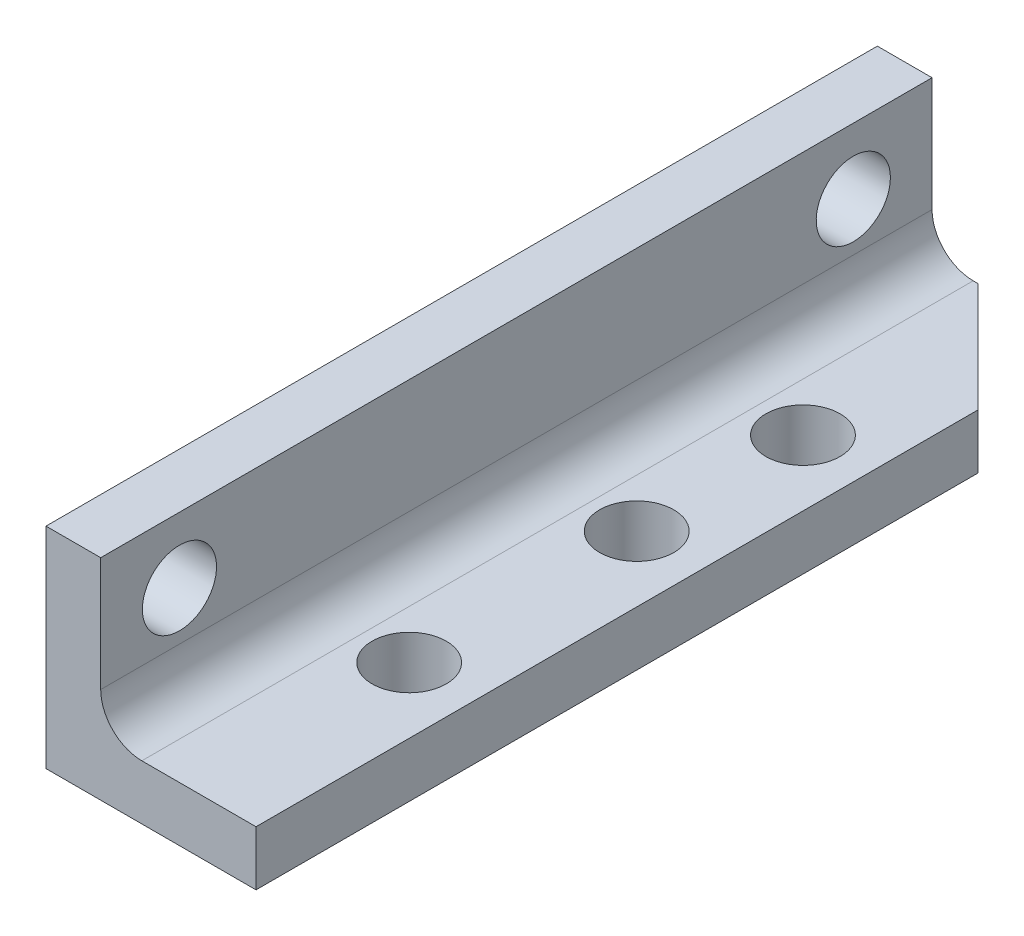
from build123d import *

# Parameters (mm, degrees)
EXTRUDE1_DEPTH                 = 24.13
F_18_0_169500_DIAMETER_HOLE2_D = 4.3053
F_18_0_169500_DIAMETER_HOLE3_D = 4.3053
CHAMFER1_SIZE                  = 6.35
F_18_0_1695_DIAMETER_HOLE1_D   = 4.3053


with BuildPart() as part:
    # Sketch1 → Extrude1 (new body)
    with BuildSketch(Plane.XY):
        with BuildLine():
            Line((3.175, 12.192), (3.175, 5.5626))
            ThreePointArc((3.175, 5.5626), (3.874311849, 3.874311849), (5.5626, 3.175))
            Line((5.5626, 3.175), (12.192, 3.175))
            Line((12.192, 3.175), (12.192, 0))
            Line((12.192, 0), (0, 0))
            Line((0, 0), (0, 12.192))
            Line((0, 12.192), (3.175, 12.192))
        make_face()
    extrude(amount=EXTRUDE1_DEPTH)

    # 18 _0.169500_ Diameter Hole2 (through all)
    with Locations(Plane.ZY):
        with Locations((19.558, 8.382)):
            Hole(F_18_0_169500_DIAMETER_HOLE2_D / 2)

    # 18 _0.169500_ Diameter Hole3 (through all)
    with Locations(Plane.XZ):
        with Locations((8.382, 11.43)):
            Hole(F_18_0_169500_DIAMETER_HOLE3_D / 2)

    # Mirror1: part across plane


with BuildPart() as part_1:
    add(part.part)
    add(part.part.mirror(Plane(origin=(5.5626, 5.5626, 0), x_dir=(1, 0, 0), z_dir=(0, 0, 1))))

    # Chamfer1
    chamfer1_edges = [part_1.edges().sort_by_distance(p)[0] for p in [
        (12.192, 1.5875, -24.13),
    ]]
    chamfer(chamfer1_edges, length=CHAMFER1_SIZE)

    # 18 _0.1695_ Diameter Hole1 (through all)
    with Locations(Plane(origin=(0, 3.175, 0), x_dir=(-1, 0, 0), z_dir=(0, 1, 0))):
        with Locations((-8.382, -1.778)):
            Hole(F_18_0_1695_DIAMETER_HOLE1_D / 2)


solid = part_1.part
